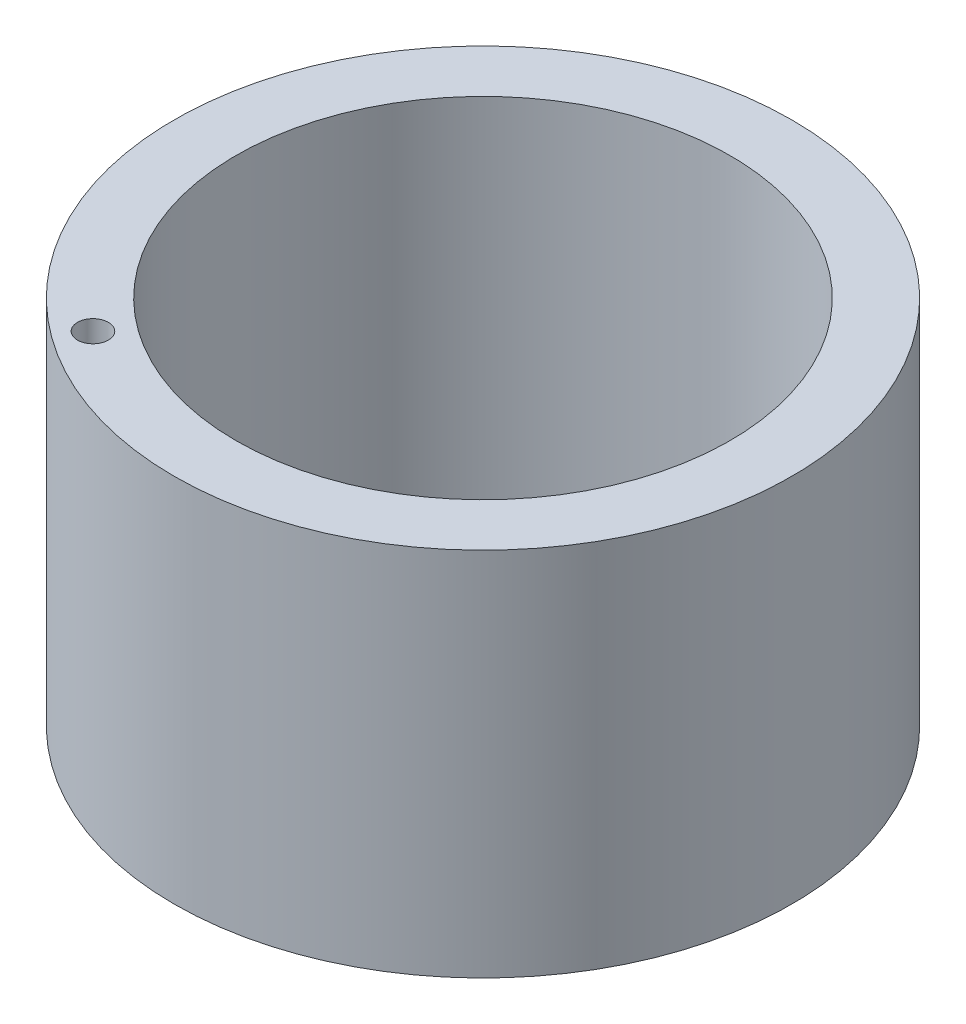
ISO-10303-21;
HEADER;
FILE_DESCRIPTION(('STEP AP214'),'2;1');
FILE_NAME('part.step','',(''),(''),'','','');
FILE_SCHEMA(('AUTOMOTIVE_DESIGN { 1 0 10303 214 1 1 1 1 }'));
ENDSEC;
DATA;
#1=APPLICATION_CONTEXT('core data for automotive mechanical design processes');
#2=APPLICATION_PROTOCOL_DEFINITION('international standard','automotive_design',2000,#1);
#3=PRODUCT_CONTEXT('',#1,'mechanical');
#4=PRODUCT('Part','Part','',(#3));
#5=PRODUCT_RELATED_PRODUCT_CATEGORY('part','',(#4));
#6=PRODUCT_DEFINITION_FORMATION('','',#4);
#7=PRODUCT_DEFINITION_CONTEXT('part definition',#1,'design');
#8=PRODUCT_DEFINITION('design','',#6,#7);
#9=PRODUCT_DEFINITION_SHAPE('','',#8);
#10=(LENGTH_UNIT() NAMED_UNIT(*) SI_UNIT(.MILLI.,.METRE.));
#11=(NAMED_UNIT(*) PLANE_ANGLE_UNIT() SI_UNIT($,.RADIAN.));
#12=(NAMED_UNIT(*) SI_UNIT($,.STERADIAN.) SOLID_ANGLE_UNIT());
#13=UNCERTAINTY_MEASURE_WITH_UNIT(LENGTH_MEASURE(1.E-05),#10,'distance_accuracy_value','');
#14=(GEOMETRIC_REPRESENTATION_CONTEXT(3) GLOBAL_UNCERTAINTY_ASSIGNED_CONTEXT((#13)) GLOBAL_UNIT_ASSIGNED_CONTEXT((#10,
#11,#12)) REPRESENTATION_CONTEXT('',''));
#15=CARTESIAN_POINT('',(0.,0.,0.));
#16=DIRECTION('',(0.,0.,1.));
#17=DIRECTION('',(1.,0.,0.));
#18=AXIS2_PLACEMENT_3D('',#15,#16,#17);
#19=CARTESIAN_POINT('',(0.,30.,0.));
#20=DIRECTION('',(0.,1.,0.));
#21=DIRECTION('',(0.,0.,1.));
#22=AXIS2_PLACEMENT_3D('',#19,#20,#21);
#23=PLANE('',#22);
#24=CARTESIAN_POINT('',(-13.4662764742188,30.,18.1148763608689));
#25=DIRECTION('',(0.,1.,0.));
#26=DIRECTION('',(0.,0.,1.));
#27=AXIS2_PLACEMENT_3D('',#24,#25,#26);
#28=CIRCLE('',#27,1.25);
#29=CARTESIAN_POINT('',(-13.4662764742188,30.,19.3648763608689));
#30=VERTEX_POINT('',#29);
#31=EDGE_CURVE('E53',#30,#30,#28,.T.);
#32=ORIENTED_EDGE('',*,*,#31,.F.);
#33=EDGE_LOOP('',(#32));
#34=FACE_BOUND('',#33,.T.);
#35=CARTESIAN_POINT('',(0.,30.,0.));
#36=DIRECTION('',(0.,1.,0.));
#37=DIRECTION('',(0.,0.,1.));
#38=AXIS2_PLACEMENT_3D('',#35,#36,#37);
#39=CIRCLE('',#38,25.);
#40=CARTESIAN_POINT('',(0.,30.,25.));
#41=VERTEX_POINT('',#40);
#42=EDGE_CURVE('E11',#41,#41,#39,.T.);
#43=ORIENTED_EDGE('',*,*,#42,.T.);
#44=EDGE_LOOP('',(#43));
#45=FACE_BOUND('',#44,.T.);
#46=CARTESIAN_POINT('',(0.,30.,0.));
#47=DIRECTION('',(0.,1.,0.));
#48=DIRECTION('',(0.,0.,1.));
#49=AXIS2_PLACEMENT_3D('',#46,#47,#48);
#50=CIRCLE('',#49,20.);
#51=CARTESIAN_POINT('',(0.,30.,20.));
#52=VERTEX_POINT('',#51);
#53=EDGE_CURVE('E56',#52,#52,#50,.T.);
#54=ORIENTED_EDGE('',*,*,#53,.F.);
#55=EDGE_LOOP('',(#54));
#56=FACE_BOUND('',#55,.T.);
#57=ADVANCED_FACE('F32',(#34,#45,#56),#23,.T.);
#58=CARTESIAN_POINT('',(0.,0.,0.));
#59=DIRECTION('',(0.,1.,0.));
#60=DIRECTION('',(0.,0.,1.));
#61=AXIS2_PLACEMENT_3D('',#58,#59,#60);
#62=PLANE('',#61);
#63=CARTESIAN_POINT('',(0.,0.,0.));
#64=DIRECTION('',(0.,1.,0.));
#65=DIRECTION('',(0.,0.,1.));
#66=AXIS2_PLACEMENT_3D('',#63,#64,#65);
#67=CIRCLE('',#66,25.);
#68=CARTESIAN_POINT('',(0.,0.,25.));
#69=VERTEX_POINT('',#68);
#70=EDGE_CURVE('E36',#69,#69,#67,.T.);
#71=ORIENTED_EDGE('',*,*,#70,.F.);
#72=EDGE_LOOP('',(#71));
#73=FACE_BOUND('',#72,.T.);
#74=CARTESIAN_POINT('',(0.,0.,0.));
#75=DIRECTION('',(0.,1.,0.));
#76=DIRECTION('',(0.,0.,1.));
#77=AXIS2_PLACEMENT_3D('',#74,#75,#76);
#78=CIRCLE('',#77,20.);
#79=CARTESIAN_POINT('',(0.,0.,20.));
#80=VERTEX_POINT('',#79);
#81=EDGE_CURVE('E52',#80,#80,#78,.T.);
#82=ORIENTED_EDGE('',*,*,#81,.T.);
#83=EDGE_LOOP('',(#82));
#84=FACE_BOUND('',#83,.T.);
#85=ADVANCED_FACE('F68',(#73,#84),#62,.F.);
#86=CARTESIAN_POINT('',(0.,30.,0.));
#87=DIRECTION('',(0.,-1.,0.));
#88=DIRECTION('',(0.,0.,-1.));
#89=AXIS2_PLACEMENT_3D('',#86,#87,#88);
#90=CYLINDRICAL_SURFACE('',#89,25.);
#91=ORIENTED_EDGE('',*,*,#42,.F.);
#92=EDGE_LOOP('',(#91));
#93=FACE_BOUND('',#92,.T.);
#94=ORIENTED_EDGE('',*,*,#70,.T.);
#95=EDGE_LOOP('',(#94));
#96=FACE_BOUND('',#95,.T.);
#97=ADVANCED_FACE('F34',(#93,#96),#90,.T.);
#98=CARTESIAN_POINT('',(0.,30.,0.));
#99=DIRECTION('',(0.,-1.,0.));
#100=DIRECTION('',(0.,0.,-1.));
#101=AXIS2_PLACEMENT_3D('',#98,#99,#100);
#102=CYLINDRICAL_SURFACE('',#101,20.);
#103=ORIENTED_EDGE('',*,*,#53,.T.);
#104=EDGE_LOOP('',(#103));
#105=FACE_BOUND('',#104,.T.);
#106=ORIENTED_EDGE('',*,*,#81,.F.);
#107=EDGE_LOOP('',(#106));
#108=FACE_BOUND('',#107,.T.);
#109=ADVANCED_FACE('F46',(#105,#108),#102,.F.);
#110=CARTESIAN_POINT('',(-13.4662764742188,5.,18.1148763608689));
#111=DIRECTION('',(0.,1.,0.));
#112=DIRECTION('',(0.,0.,1.));
#113=AXIS2_PLACEMENT_3D('',#110,#111,#112);
#114=CONICAL_SURFACE('',#113,1.24999999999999,1.02974425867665);
#115=CARTESIAN_POINT('',(-13.4662764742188,4.24892422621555,18.1148763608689));
#116=VERTEX_POINT('',#115);
#117=VERTEX_LOOP('',#116);
#118=FACE_BOUND('',#117,.T.);
#119=CARTESIAN_POINT('',(-13.4662764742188,5.,18.1148763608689));
#120=DIRECTION('',(0.,1.,0.));
#121=DIRECTION('',(0.,0.,1.));
#122=AXIS2_PLACEMENT_3D('',#119,#120,#121);
#123=CIRCLE('',#122,1.24999999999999);
#124=CARTESIAN_POINT('',(-13.4662764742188,5.,19.3648763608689));
#125=VERTEX_POINT('',#124);
#126=EDGE_CURVE('E50',#125,#125,#123,.T.);
#127=ORIENTED_EDGE('',*,*,#126,.T.);
#128=EDGE_LOOP('',(#127));
#129=FACE_BOUND('',#128,.T.);
#130=ADVANCED_FACE('F42',(#118,#129),#114,.F.);
#131=CARTESIAN_POINT('',(-13.4662764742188,30.,18.1148763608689));
#132=DIRECTION('',(0.,1.,0.));
#133=DIRECTION('',(0.,0.,1.));
#134=AXIS2_PLACEMENT_3D('',#131,#132,#133);
#135=CYLINDRICAL_SURFACE('',#134,1.25);
#136=ORIENTED_EDGE('',*,*,#126,.F.);
#137=EDGE_LOOP('',(#136));
#138=FACE_BOUND('',#137,.T.);
#139=ORIENTED_EDGE('',*,*,#31,.T.);
#140=EDGE_LOOP('',(#139));
#141=FACE_BOUND('',#140,.T.);
#142=ADVANCED_FACE('F45',(#138,#141),#135,.F.);
#143=CLOSED_SHELL('',(#57,#85,#97,#109,#130,#142));
#144=MANIFOLD_SOLID_BREP('B2',#143);
#145=ADVANCED_BREP_SHAPE_REPRESENTATION('',(#18,#144),#14);
#146=SHAPE_DEFINITION_REPRESENTATION(#9,#145);
ENDSEC;
END-ISO-10303-21;
